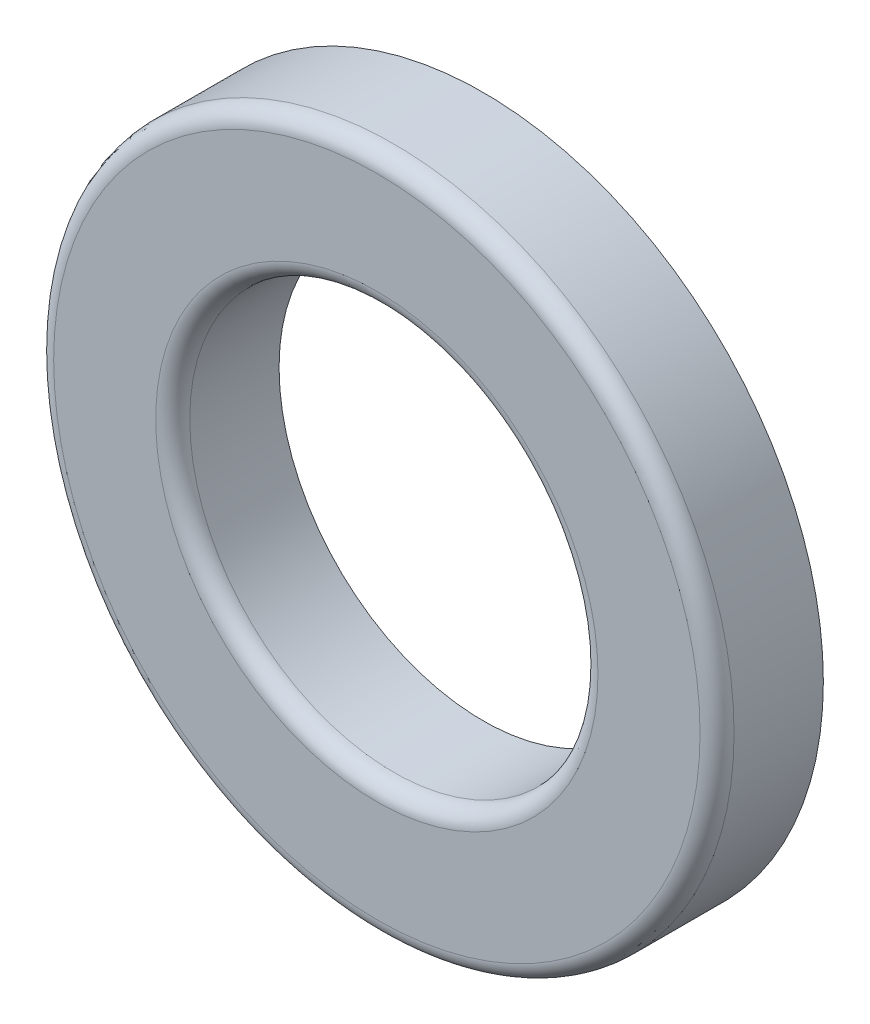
from build123d import *

# Parameters (mm, degrees)
SKETCH1_R      = 2.54
SKETCH1_R_2    = 1.524
EXTRUDE1_DEPTH = 0.79375
FILLET1_R      = 0.127


with BuildPart() as part:
    # Sketch1 → Extrude1 (new body)
    with BuildSketch(Plane.XY):
        Circle(SKETCH1_R)
        Circle(SKETCH1_R_2, mode=Mode.SUBTRACT)
    extrude(amount=EXTRUDE1_DEPTH)

    # Fillet1
    fillet1_edges = [part.edges().sort_by_distance(p)[0] for p in [
        (-2.54, 0, 0.79375),
        (-1.524, 0, 0.79375),
    ]]
    fillet(fillet1_edges, radius=FILLET1_R)


solid = part.part
